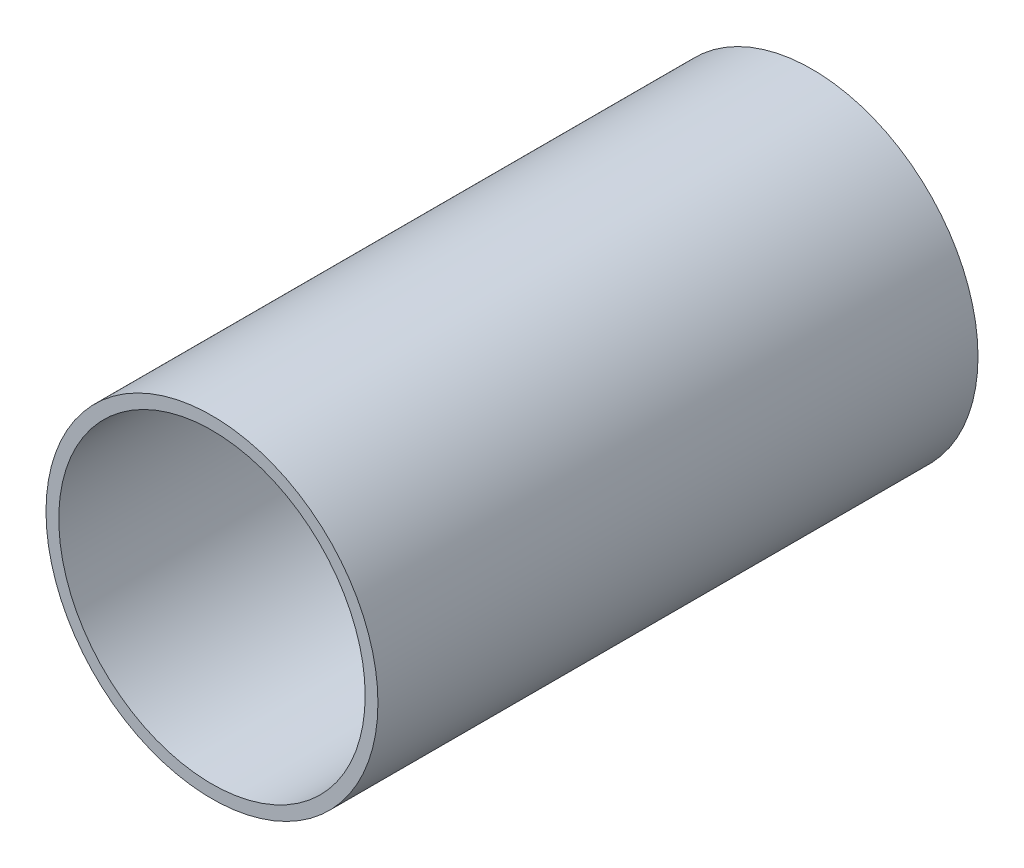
ISO-10303-21;
HEADER;
FILE_DESCRIPTION(('STEP AP214'),'2;1');
FILE_NAME('part.step','',(''),(''),'','','');
FILE_SCHEMA(('AUTOMOTIVE_DESIGN { 1 0 10303 214 1 1 1 1 }'));
ENDSEC;
DATA;
#1=APPLICATION_CONTEXT('core data for automotive mechanical design processes');
#2=APPLICATION_PROTOCOL_DEFINITION('international standard','automotive_design',2000,#1);
#3=PRODUCT_CONTEXT('',#1,'mechanical');
#4=PRODUCT('Part','Part','',(#3));
#5=PRODUCT_RELATED_PRODUCT_CATEGORY('part','',(#4));
#6=PRODUCT_DEFINITION_FORMATION('','',#4);
#7=PRODUCT_DEFINITION_CONTEXT('part definition',#1,'design');
#8=PRODUCT_DEFINITION('design','',#6,#7);
#9=PRODUCT_DEFINITION_SHAPE('','',#8);
#10=(LENGTH_UNIT() NAMED_UNIT(*) SI_UNIT(.MILLI.,.METRE.));
#11=(NAMED_UNIT(*) PLANE_ANGLE_UNIT() SI_UNIT($,.RADIAN.));
#12=(NAMED_UNIT(*) SI_UNIT($,.STERADIAN.) SOLID_ANGLE_UNIT());
#13=UNCERTAINTY_MEASURE_WITH_UNIT(LENGTH_MEASURE(1.E-05),#10,'distance_accuracy_value','');
#14=(GEOMETRIC_REPRESENTATION_CONTEXT(3) GLOBAL_UNCERTAINTY_ASSIGNED_CONTEXT((#13)) GLOBAL_UNIT_ASSIGNED_CONTEXT((#10,
#11,#12)) REPRESENTATION_CONTEXT('',''));
#15=CARTESIAN_POINT('',(0.,0.,0.));
#16=DIRECTION('',(0.,0.,1.));
#17=DIRECTION('',(1.,0.,0.));
#18=AXIS2_PLACEMENT_3D('',#15,#16,#17);
#19=CARTESIAN_POINT('',(0.,0.,149.225));
#20=DIRECTION('',(0.,0.,1.));
#21=DIRECTION('',(1.,0.,0.));
#22=AXIS2_PLACEMENT_3D('',#19,#20,#21);
#23=PLANE('',#22);
#24=CARTESIAN_POINT('',(0.,0.,149.225));
#25=DIRECTION('',(0.,0.,1.));
#26=DIRECTION('',(1.,0.,0.));
#27=AXIS2_PLACEMENT_3D('',#24,#25,#26);
#28=CIRCLE('',#27,82.55);
#29=CARTESIAN_POINT('',(82.55,0.,149.225));
#30=VERTEX_POINT('',#29);
#31=EDGE_CURVE('E10',#30,#30,#28,.T.);
#32=ORIENTED_EDGE('',*,*,#31,.T.);
#33=EDGE_LOOP('',(#32));
#34=FACE_BOUND('',#33,.T.);
#35=CARTESIAN_POINT('',(0.,0.,149.225));
#36=DIRECTION('',(0.,0.,1.));
#37=DIRECTION('',(1.,0.,0.));
#38=AXIS2_PLACEMENT_3D('',#35,#36,#37);
#39=CIRCLE('',#38,76.2);
#40=CARTESIAN_POINT('',(76.2,0.,149.225));
#41=VERTEX_POINT('',#40);
#42=EDGE_CURVE('E41',#41,#41,#39,.T.);
#43=ORIENTED_EDGE('',*,*,#42,.F.);
#44=EDGE_LOOP('',(#43));
#45=FACE_BOUND('',#44,.T.);
#46=ADVANCED_FACE('F30',(#34,#45),#23,.T.);
#47=CARTESIAN_POINT('',(0.,0.,-149.225));
#48=DIRECTION('',(0.,0.,1.));
#49=DIRECTION('',(1.,0.,0.));
#50=AXIS2_PLACEMENT_3D('',#47,#48,#49);
#51=PLANE('',#50);
#52=CARTESIAN_POINT('',(0.,0.,-149.225));
#53=DIRECTION('',(0.,0.,1.));
#54=DIRECTION('',(1.,0.,0.));
#55=AXIS2_PLACEMENT_3D('',#52,#53,#54);
#56=CIRCLE('',#55,82.55);
#57=CARTESIAN_POINT('',(82.55,0.,-149.225));
#58=VERTEX_POINT('',#57);
#59=EDGE_CURVE('E34',#58,#58,#56,.T.);
#60=ORIENTED_EDGE('',*,*,#59,.F.);
#61=EDGE_LOOP('',(#60));
#62=FACE_BOUND('',#61,.T.);
#63=CARTESIAN_POINT('',(0.,0.,-149.225));
#64=DIRECTION('',(0.,0.,1.));
#65=DIRECTION('',(1.,0.,0.));
#66=AXIS2_PLACEMENT_3D('',#63,#64,#65);
#67=CIRCLE('',#66,76.2);
#68=CARTESIAN_POINT('',(76.2,0.,-149.225));
#69=VERTEX_POINT('',#68);
#70=EDGE_CURVE('E43',#69,#69,#67,.T.);
#71=ORIENTED_EDGE('',*,*,#70,.T.);
#72=EDGE_LOOP('',(#71));
#73=FACE_BOUND('',#72,.T.);
#74=ADVANCED_FACE('F53',(#62,#73),#51,.F.);
#75=CARTESIAN_POINT('',(0.,0.,149.225));
#76=DIRECTION('',(0.,0.,-1.));
#77=DIRECTION('',(-1.,0.,0.));
#78=AXIS2_PLACEMENT_3D('',#75,#76,#77);
#79=CYLINDRICAL_SURFACE('',#78,82.55);
#80=ORIENTED_EDGE('',*,*,#31,.F.);
#81=EDGE_LOOP('',(#80));
#82=FACE_BOUND('',#81,.T.);
#83=ORIENTED_EDGE('',*,*,#59,.T.);
#84=EDGE_LOOP('',(#83));
#85=FACE_BOUND('',#84,.T.);
#86=ADVANCED_FACE('F32',(#82,#85),#79,.T.);
#87=CARTESIAN_POINT('',(0.,0.,149.225));
#88=DIRECTION('',(0.,0.,-1.));
#89=DIRECTION('',(-1.,0.,0.));
#90=AXIS2_PLACEMENT_3D('',#87,#88,#89);
#91=CYLINDRICAL_SURFACE('',#90,76.2);
#92=ORIENTED_EDGE('',*,*,#42,.T.);
#93=EDGE_LOOP('',(#92));
#94=FACE_BOUND('',#93,.T.);
#95=ORIENTED_EDGE('',*,*,#70,.F.);
#96=EDGE_LOOP('',(#95));
#97=FACE_BOUND('',#96,.T.);
#98=ADVANCED_FACE('F49',(#94,#97),#91,.F.);
#99=CLOSED_SHELL('',(#46,#74,#86,#98));
#100=MANIFOLD_SOLID_BREP('B2',#99);
#101=ADVANCED_BREP_SHAPE_REPRESENTATION('',(#18,#100),#14);
#102=SHAPE_DEFINITION_REPRESENTATION(#9,#101);
ENDSEC;
END-ISO-10303-21;
